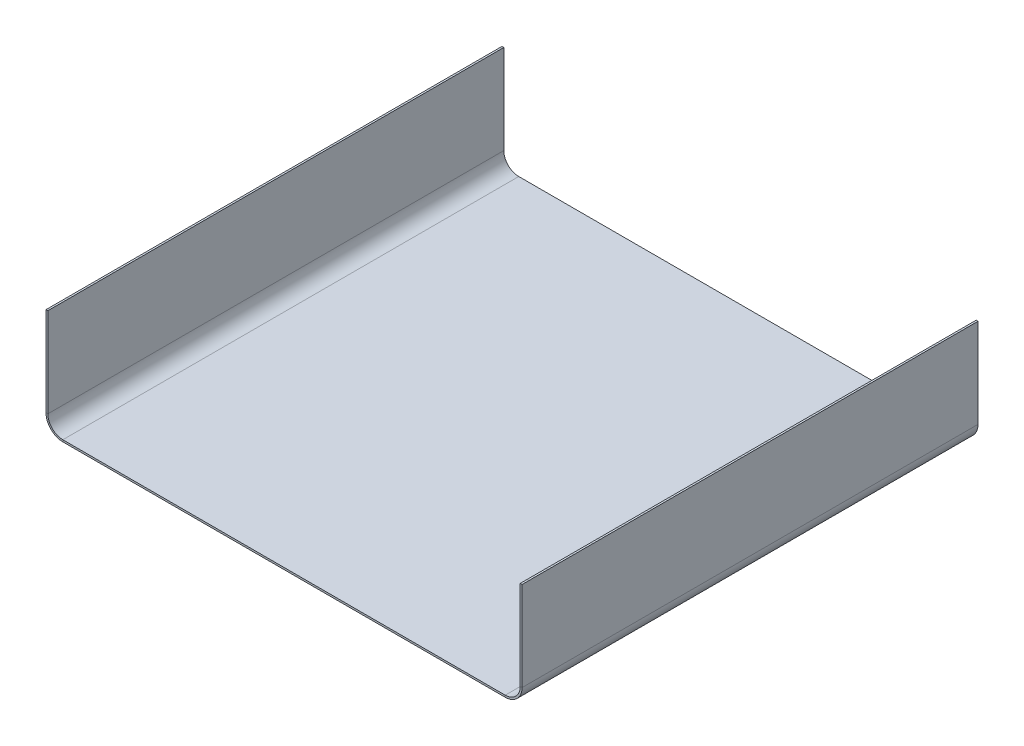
ISO-10303-21;
HEADER;
FILE_DESCRIPTION(('STEP AP214'),'2;1');
FILE_NAME('part.step','',(''),(''),'','','');
FILE_SCHEMA(('AUTOMOTIVE_DESIGN { 1 0 10303 214 1 1 1 1 }'));
ENDSEC;
DATA;
#1=APPLICATION_CONTEXT('core data for automotive mechanical design processes');
#2=APPLICATION_PROTOCOL_DEFINITION('international standard','automotive_design',2000,#1);
#3=PRODUCT_CONTEXT('',#1,'mechanical');
#4=PRODUCT('Part','Part','',(#3));
#5=PRODUCT_RELATED_PRODUCT_CATEGORY('part','',(#4));
#6=PRODUCT_DEFINITION_FORMATION('','',#4);
#7=PRODUCT_DEFINITION_CONTEXT('part definition',#1,'design');
#8=PRODUCT_DEFINITION('design','',#6,#7);
#9=PRODUCT_DEFINITION_SHAPE('','',#8);
#10=(LENGTH_UNIT() NAMED_UNIT(*) SI_UNIT(.MILLI.,.METRE.));
#11=(NAMED_UNIT(*) PLANE_ANGLE_UNIT() SI_UNIT($,.RADIAN.));
#12=(NAMED_UNIT(*) SI_UNIT($,.STERADIAN.) SOLID_ANGLE_UNIT());
#13=UNCERTAINTY_MEASURE_WITH_UNIT(LENGTH_MEASURE(1.E-05),#10,'distance_accuracy_value','');
#14=(GEOMETRIC_REPRESENTATION_CONTEXT(3) GLOBAL_UNCERTAINTY_ASSIGNED_CONTEXT((#13)) GLOBAL_UNIT_ASSIGNED_CONTEXT((#10,
#11,#12)) REPRESENTATION_CONTEXT('',''));
#15=CARTESIAN_POINT('',(0.,0.,0.));
#16=DIRECTION('',(0.,0.,1.));
#17=DIRECTION('',(1.,0.,0.));
#18=AXIS2_PLACEMENT_3D('',#15,#16,#17);
#19=CARTESIAN_POINT('',(-96.3051310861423,0.,193.548));
#20=DIRECTION('',(0.,0.,1.));
#21=DIRECTION('',(1.,0.,0.));
#22=AXIS2_PLACEMENT_3D('',#19,#20,#21);
#23=PLANE('',#22);
#24=DIRECTION('',(0.,-1.,0.));
#25=VECTOR('',#24,1.);
#26=CARTESIAN_POINT('',(-96.3051310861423,0.,193.548));
#27=LINE('',#26,#25);
#28=CARTESIAN_POINT('',(-96.3051310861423,0.,193.548));
#29=VERTEX_POINT('',#28);
#30=CARTESIAN_POINT('',(-96.3051310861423,-0.7874,193.548));
#31=VERTEX_POINT('',#30);
#32=EDGE_CURVE('E11',#29,#31,#27,.T.);
#33=ORIENTED_EDGE('',*,*,#32,.F.);
#34=CARTESIAN_POINT('',(-96.3051310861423,6.35,193.548));
#35=DIRECTION('',(0.,0.,-1.));
#36=DIRECTION('',(-1.,0.,0.));
#37=AXIS2_PLACEMENT_3D('',#34,#35,#36);
#38=CIRCLE('',#37,6.35);
#39=CARTESIAN_POINT('',(-102.655131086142,6.35,193.548));
#40=VERTEX_POINT('',#39);
#41=EDGE_CURVE('E243',#40,#29,#38,.F.);
#42=ORIENTED_EDGE('',*,*,#41,.F.);
#43=DIRECTION('',(1.,0.,0.));
#44=VECTOR('',#43,1.);
#45=CARTESIAN_POINT('',(-103.442531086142,6.35,193.548));
#46=LINE('',#45,#44);
#47=CARTESIAN_POINT('',(-103.442531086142,6.35,193.548));
#48=VERTEX_POINT('',#47);
#49=EDGE_CURVE('E41',#48,#40,#46,.T.);
#50=ORIENTED_EDGE('',*,*,#49,.F.);
#51=CARTESIAN_POINT('',(-96.3051310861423,6.35,193.548));
#52=DIRECTION('',(0.,0.,1.));
#53=DIRECTION('',(1.,0.,0.));
#54=AXIS2_PLACEMENT_3D('',#51,#52,#53);
#55=CIRCLE('',#54,7.1374);
#56=EDGE_CURVE('E142',#48,#31,#55,.T.);
#57=ORIENTED_EDGE('',*,*,#56,.T.);
#58=EDGE_LOOP('',(#33,#42,#50,#57));
#59=FACE_BOUND('',#58,.T.);
#60=ADVANCED_FACE('F33',(#59),#23,.T.);
#61=CARTESIAN_POINT('',(-103.442531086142,6.35,193.548));
#62=DIRECTION('',(0.,0.,1.));
#63=DIRECTION('',(1.,0.,0.));
#64=AXIS2_PLACEMENT_3D('',#61,#62,#63);
#65=PLANE('',#64);
#66=DIRECTION('',(1.,0.,0.));
#67=VECTOR('',#66,1.);
#68=CARTESIAN_POINT('',(-102.655131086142,0.,193.548));
#69=LINE('',#68,#67);
#70=CARTESIAN_POINT('',(91.505670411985,0.,193.548));
#71=VERTEX_POINT('',#70);
#72=EDGE_CURVE('E136',#29,#71,#69,.T.);
#73=ORIENTED_EDGE('',*,*,#72,.F.);
#74=ORIENTED_EDGE('',*,*,#32,.T.);
#75=DIRECTION('',(1.,0.,0.));
#76=VECTOR('',#75,1.);
#77=CARTESIAN_POINT('',(-102.655131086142,-0.7874,193.548));
#78=LINE('',#77,#76);
#79=CARTESIAN_POINT('',(91.505670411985,-0.7874,193.548));
#80=VERTEX_POINT('',#79);
#81=EDGE_CURVE('E133',#31,#80,#78,.T.);
#82=ORIENTED_EDGE('',*,*,#81,.T.);
#83=DIRECTION('',(0.,1.,0.));
#84=VECTOR('',#83,1.);
#85=CARTESIAN_POINT('',(91.505670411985,-0.7874,193.548));
#86=LINE('',#85,#84);
#87=EDGE_CURVE('E224',#80,#71,#86,.T.);
#88=ORIENTED_EDGE('',*,*,#87,.T.);
#89=EDGE_LOOP('',(#73,#74,#82,#88));
#90=FACE_BOUND('',#89,.T.);
#91=ADVANCED_FACE('F131',(#90),#65,.T.);
#92=CARTESIAN_POINT('',(-102.655131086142,6.35,0.));
#93=DIRECTION('',(0.,0.,-1.));
#94=DIRECTION('',(-1.,0.,0.));
#95=AXIS2_PLACEMENT_3D('',#92,#93,#94);
#96=PLANE('',#95);
#97=DIRECTION('',(-1.,0.,0.));
#98=VECTOR('',#97,1.);
#99=CARTESIAN_POINT('',(-102.655131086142,6.35,0.));
#100=LINE('',#99,#98);
#101=CARTESIAN_POINT('',(-102.655131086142,6.35,0.));
#102=VERTEX_POINT('',#101);
#103=CARTESIAN_POINT('',(-103.442531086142,6.35,0.));
#104=VERTEX_POINT('',#103);
#105=EDGE_CURVE('E229',#102,#104,#100,.T.);
#106=ORIENTED_EDGE('',*,*,#105,.F.);
#107=CARTESIAN_POINT('',(-96.3051310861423,6.35,0.));
#108=DIRECTION('',(0.,0.,-1.));
#109=DIRECTION('',(-1.,0.,0.));
#110=AXIS2_PLACEMENT_3D('',#107,#108,#109);
#111=CIRCLE('',#110,6.35);
#112=CARTESIAN_POINT('',(-96.3051310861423,0.,0.));
#113=VERTEX_POINT('',#112);
#114=EDGE_CURVE('E181',#102,#113,#111,.F.);
#115=ORIENTED_EDGE('',*,*,#114,.T.);
#116=DIRECTION('',(0.,1.,0.));
#117=VECTOR('',#116,1.);
#118=CARTESIAN_POINT('',(-96.3051310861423,-0.7874,0.));
#119=LINE('',#118,#117);
#120=CARTESIAN_POINT('',(-96.3051310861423,-0.7874,0.));
#121=VERTEX_POINT('',#120);
#122=EDGE_CURVE('E227',#121,#113,#119,.T.);
#123=ORIENTED_EDGE('',*,*,#122,.F.);
#124=CARTESIAN_POINT('',(-96.3051310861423,6.35,0.));
#125=DIRECTION('',(0.,0.,1.));
#126=DIRECTION('',(1.,0.,0.));
#127=AXIS2_PLACEMENT_3D('',#124,#125,#126);
#128=CIRCLE('',#127,7.1374);
#129=EDGE_CURVE('E154',#104,#121,#128,.T.);
#130=ORIENTED_EDGE('',*,*,#129,.F.);
#131=EDGE_LOOP('',(#106,#115,#123,#130));
#132=FACE_BOUND('',#131,.T.);
#133=ADVANCED_FACE('F281',(#132),#96,.T.);
#134=CARTESIAN_POINT('',(-96.3051310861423,-0.7874,0.));
#135=DIRECTION('',(0.,0.,-1.));
#136=DIRECTION('',(-1.,0.,0.));
#137=AXIS2_PLACEMENT_3D('',#134,#135,#136);
#138=PLANE('',#137);
#139=DIRECTION('',(0.,-1.,0.));
#140=VECTOR('',#139,1.);
#141=CARTESIAN_POINT('',(-102.655131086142,44.2616928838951,0.));
#142=LINE('',#141,#140);
#143=CARTESIAN_POINT('',(-102.655131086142,44.2616928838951,0.));
#144=VERTEX_POINT('',#143);
#145=EDGE_CURVE('E184',#144,#102,#142,.T.);
#146=ORIENTED_EDGE('',*,*,#145,.T.);
#147=ORIENTED_EDGE('',*,*,#105,.T.);
#148=DIRECTION('',(0.,1.,0.));
#149=VECTOR('',#148,1.);
#150=CARTESIAN_POINT('',(-103.442531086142,44.2616928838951,0.));
#151=LINE('',#150,#149);
#152=CARTESIAN_POINT('',(-103.442531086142,44.2616928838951,0.));
#153=VERTEX_POINT('',#152);
#154=EDGE_CURVE('E190',#153,#104,#151,.F.);
#155=ORIENTED_EDGE('',*,*,#154,.F.);
#156=DIRECTION('',(1.,0.,0.));
#157=VECTOR('',#156,1.);
#158=CARTESIAN_POINT('',(-103.442531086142,44.2616928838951,0.));
#159=LINE('',#158,#157);
#160=EDGE_CURVE('E187',#153,#144,#159,.T.);
#161=ORIENTED_EDGE('',*,*,#160,.T.);
#162=EDGE_LOOP('',(#146,#147,#155,#161));
#163=FACE_BOUND('',#162,.T.);
#164=ADVANCED_FACE('F284',(#163),#138,.T.);
#165=CARTESIAN_POINT('',(97.855670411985,6.35,193.548));
#166=DIRECTION('',(0.,0.,1.));
#167=DIRECTION('',(1.,0.,0.));
#168=AXIS2_PLACEMENT_3D('',#165,#166,#167);
#169=PLANE('',#168);
#170=DIRECTION('',(1.,0.,0.));
#171=VECTOR('',#170,1.);
#172=CARTESIAN_POINT('',(97.855670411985,6.35,193.548));
#173=LINE('',#172,#171);
#174=CARTESIAN_POINT('',(97.855670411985,6.35,193.548));
#175=VERTEX_POINT('',#174);
#176=CARTESIAN_POINT('',(98.643070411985,6.35,193.548));
#177=VERTEX_POINT('',#176);
#178=EDGE_CURVE('E49',#175,#177,#173,.T.);
#179=ORIENTED_EDGE('',*,*,#178,.F.);
#180=CARTESIAN_POINT('',(91.505670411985,6.35,193.548));
#181=DIRECTION('',(0.,0.,-1.));
#182=DIRECTION('',(-1.,0.,0.));
#183=AXIS2_PLACEMENT_3D('',#180,#181,#182);
#184=CIRCLE('',#183,6.35);
#185=EDGE_CURVE('E253',#71,#175,#184,.F.);
#186=ORIENTED_EDGE('',*,*,#185,.F.);
#187=ORIENTED_EDGE('',*,*,#87,.F.);
#188=CARTESIAN_POINT('',(91.505670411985,6.35,193.548));
#189=DIRECTION('',(0.,0.,1.));
#190=DIRECTION('',(1.,0.,0.));
#191=AXIS2_PLACEMENT_3D('',#188,#189,#190);
#192=CIRCLE('',#191,7.1374);
#193=EDGE_CURVE('E162',#80,#177,#192,.T.);
#194=ORIENTED_EDGE('',*,*,#193,.T.);
#195=EDGE_LOOP('',(#179,#186,#187,#194));
#196=FACE_BOUND('',#195,.T.);
#197=ADVANCED_FACE('F276',(#196),#169,.T.);
#198=CARTESIAN_POINT('',(91.505670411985,-0.7874,193.548));
#199=DIRECTION('',(0.,0.,1.));
#200=DIRECTION('',(1.,0.,0.));
#201=AXIS2_PLACEMENT_3D('',#198,#199,#200);
#202=PLANE('',#201);
#203=DIRECTION('',(0.,1.,0.));
#204=VECTOR('',#203,1.);
#205=CARTESIAN_POINT('',(97.855670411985,0.,193.548));
#206=LINE('',#205,#204);
#207=CARTESIAN_POINT('',(97.855670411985,44.2616928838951,193.548));
#208=VERTEX_POINT('',#207);
#209=EDGE_CURVE('E256',#175,#208,#206,.T.);
#210=ORIENTED_EDGE('',*,*,#209,.F.);
#211=ORIENTED_EDGE('',*,*,#178,.T.);
#212=DIRECTION('',(0.,1.,0.));
#213=VECTOR('',#212,1.);
#214=CARTESIAN_POINT('',(98.643070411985,0.,193.548));
#215=LINE('',#214,#213);
#216=CARTESIAN_POINT('',(98.643070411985,44.2616928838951,193.548));
#217=VERTEX_POINT('',#216);
#218=EDGE_CURVE('E103',#177,#217,#215,.T.);
#219=ORIENTED_EDGE('',*,*,#218,.T.);
#220=DIRECTION('',(1.,0.,0.));
#221=VECTOR('',#220,1.);
#222=CARTESIAN_POINT('',(97.855670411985,44.2616928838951,193.548));
#223=LINE('',#222,#221);
#224=EDGE_CURVE('E259',#208,#217,#223,.T.);
#225=ORIENTED_EDGE('',*,*,#224,.F.);
#226=EDGE_LOOP('',(#210,#211,#219,#225));
#227=FACE_BOUND('',#226,.T.);
#228=ADVANCED_FACE('F265',(#227),#202,.T.);
#229=CARTESIAN_POINT('',(91.505670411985,0.,0.));
#230=DIRECTION('',(0.,0.,-1.));
#231=DIRECTION('',(-1.,0.,0.));
#232=AXIS2_PLACEMENT_3D('',#229,#230,#231);
#233=PLANE('',#232);
#234=DIRECTION('',(0.,-1.,0.));
#235=VECTOR('',#234,1.);
#236=CARTESIAN_POINT('',(91.505670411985,0.,0.));
#237=LINE('',#236,#235);
#238=CARTESIAN_POINT('',(91.505670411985,0.,0.));
#239=VERTEX_POINT('',#238);
#240=CARTESIAN_POINT('',(91.505670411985,-0.7874,0.));
#241=VERTEX_POINT('',#240);
#242=EDGE_CURVE('E90',#239,#241,#237,.T.);
#243=ORIENTED_EDGE('',*,*,#242,.F.);
#244=CARTESIAN_POINT('',(91.505670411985,6.35,0.));
#245=DIRECTION('',(0.,0.,-1.));
#246=DIRECTION('',(-1.,0.,0.));
#247=AXIS2_PLACEMENT_3D('',#244,#245,#246);
#248=CIRCLE('',#247,6.35);
#249=CARTESIAN_POINT('',(97.855670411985,6.35,0.));
#250=VERTEX_POINT('',#249);
#251=EDGE_CURVE('E177',#239,#250,#248,.F.);
#252=ORIENTED_EDGE('',*,*,#251,.T.);
#253=DIRECTION('',(-1.,0.,0.));
#254=VECTOR('',#253,1.);
#255=CARTESIAN_POINT('',(98.643070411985,6.35,0.));
#256=LINE('',#255,#254);
#257=CARTESIAN_POINT('',(98.643070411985,6.35,0.));
#258=VERTEX_POINT('',#257);
#259=EDGE_CURVE('E97',#258,#250,#256,.T.);
#260=ORIENTED_EDGE('',*,*,#259,.F.);
#261=CARTESIAN_POINT('',(91.505670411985,6.35,0.));
#262=DIRECTION('',(0.,0.,1.));
#263=DIRECTION('',(1.,0.,0.));
#264=AXIS2_PLACEMENT_3D('',#261,#262,#263);
#265=CIRCLE('',#264,7.1374);
#266=EDGE_CURVE('E196',#241,#258,#265,.T.);
#267=ORIENTED_EDGE('',*,*,#266,.F.);
#268=EDGE_LOOP('',(#243,#252,#260,#267));
#269=FACE_BOUND('',#268,.T.);
#270=ADVANCED_FACE('F313',(#269),#233,.T.);
#271=CARTESIAN_POINT('',(98.643070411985,6.35,0.));
#272=DIRECTION('',(0.,0.,-1.));
#273=DIRECTION('',(-1.,0.,0.));
#274=AXIS2_PLACEMENT_3D('',#271,#272,#273);
#275=PLANE('',#274);
#276=DIRECTION('',(1.,0.,0.));
#277=VECTOR('',#276,1.);
#278=CARTESIAN_POINT('',(-102.655131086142,0.,0.));
#279=LINE('',#278,#277);
#280=EDGE_CURVE('E179',#113,#239,#279,.T.);
#281=ORIENTED_EDGE('',*,*,#280,.T.);
#282=ORIENTED_EDGE('',*,*,#242,.T.);
#283=DIRECTION('',(1.,0.,0.));
#284=VECTOR('',#283,1.);
#285=CARTESIAN_POINT('',(-102.655131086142,-0.7874,0.));
#286=LINE('',#285,#284);
#287=EDGE_CURVE('E194',#121,#241,#286,.T.);
#288=ORIENTED_EDGE('',*,*,#287,.F.);
#289=ORIENTED_EDGE('',*,*,#122,.T.);
#290=EDGE_LOOP('',(#281,#282,#288,#289));
#291=FACE_BOUND('',#290,.T.);
#292=ADVANCED_FACE('F316',(#291),#275,.T.);
#293=CARTESIAN_POINT('',(98.643070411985,0.,193.548));
#294=DIRECTION('',(-1.,0.,0.));
#295=DIRECTION('',(0.,0.,1.));
#296=AXIS2_PLACEMENT_3D('',#293,#294,#295);
#297=PLANE('',#296);
#298=DIRECTION('',(0.,1.,0.));
#299=VECTOR('',#298,1.);
#300=CARTESIAN_POINT('',(98.643070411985,0.,0.));
#301=LINE('',#300,#299);
#302=CARTESIAN_POINT('',(98.643070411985,44.2616928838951,0.));
#303=VERTEX_POINT('',#302);
#304=EDGE_CURVE('E168',#258,#303,#301,.T.);
#305=ORIENTED_EDGE('',*,*,#304,.T.);
#306=DIRECTION('',(0.,0.,-1.));
#307=VECTOR('',#306,1.);
#308=CARTESIAN_POINT('',(98.643070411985,44.2616928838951,193.548));
#309=LINE('',#308,#307);
#310=EDGE_CURVE('E220',#217,#303,#309,.T.);
#311=ORIENTED_EDGE('',*,*,#310,.F.);
#312=ORIENTED_EDGE('',*,*,#218,.F.);
#313=DIRECTION('',(0.,0.,-1.));
#314=VECTOR('',#313,1.);
#315=CARTESIAN_POINT('',(98.643070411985,6.35,193.548));
#316=LINE('',#315,#314);
#317=EDGE_CURVE('E164',#177,#258,#316,.T.);
#318=ORIENTED_EDGE('',*,*,#317,.T.);
#319=EDGE_LOOP('',(#305,#311,#312,#318));
#320=FACE_BOUND('',#319,.T.);
#321=ADVANCED_FACE('F319',(#320),#297,.F.);
#322=CARTESIAN_POINT('',(97.855670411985,44.2616928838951,193.548));
#323=DIRECTION('',(0.,1.,0.));
#324=DIRECTION('',(0.,0.,1.));
#325=AXIS2_PLACEMENT_3D('',#322,#323,#324);
#326=PLANE('',#325);
#327=DIRECTION('',(1.,0.,0.));
#328=VECTOR('',#327,1.);
#329=CARTESIAN_POINT('',(97.855670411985,44.2616928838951,0.));
#330=LINE('',#329,#328);
#331=CARTESIAN_POINT('',(97.855670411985,44.2616928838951,0.));
#332=VERTEX_POINT('',#331);
#333=EDGE_CURVE('E171',#332,#303,#330,.T.);
#334=ORIENTED_EDGE('',*,*,#333,.F.);
#335=DIRECTION('',(0.,0.,-1.));
#336=VECTOR('',#335,1.);
#337=CARTESIAN_POINT('',(97.855670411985,44.2616928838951,193.548));
#338=LINE('',#337,#336);
#339=EDGE_CURVE('E218',#208,#332,#338,.T.);
#340=ORIENTED_EDGE('',*,*,#339,.F.);
#341=ORIENTED_EDGE('',*,*,#224,.T.);
#342=ORIENTED_EDGE('',*,*,#310,.T.);
#343=EDGE_LOOP('',(#334,#340,#341,#342));
#344=FACE_BOUND('',#343,.T.);
#345=ADVANCED_FACE('F264',(#344),#326,.T.);
#346=CARTESIAN_POINT('',(97.855670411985,0.,193.548));
#347=DIRECTION('',(-1.,0.,0.));
#348=DIRECTION('',(0.,0.,1.));
#349=AXIS2_PLACEMENT_3D('',#346,#347,#348);
#350=PLANE('',#349);
#351=DIRECTION('',(0.,1.,0.));
#352=VECTOR('',#351,1.);
#353=CARTESIAN_POINT('',(97.855670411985,0.,0.));
#354=LINE('',#353,#352);
#355=EDGE_CURVE('E174',#250,#332,#354,.T.);
#356=ORIENTED_EDGE('',*,*,#355,.F.);
#357=DIRECTION('',(0.,0.,-1.));
#358=VECTOR('',#357,1.);
#359=CARTESIAN_POINT('',(97.855670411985,6.35,193.548));
#360=LINE('',#359,#358);
#361=EDGE_CURVE('E215',#175,#250,#360,.T.);
#362=ORIENTED_EDGE('',*,*,#361,.F.);
#363=ORIENTED_EDGE('',*,*,#209,.T.);
#364=ORIENTED_EDGE('',*,*,#339,.T.);
#365=EDGE_LOOP('',(#356,#362,#363,#364));
#366=FACE_BOUND('',#365,.T.);
#367=ADVANCED_FACE('F269',(#366),#350,.T.);
#368=CARTESIAN_POINT('',(91.505670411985,6.35,193.548));
#369=DIRECTION('',(0.,0.,-1.));
#370=DIRECTION('',(-1.,0.,0.));
#371=AXIS2_PLACEMENT_3D('',#368,#369,#370);
#372=CYLINDRICAL_SURFACE('',#371,6.35);
#373=ORIENTED_EDGE('',*,*,#251,.F.);
#374=DIRECTION('',(0.,0.,-1.));
#375=VECTOR('',#374,1.);
#376=CARTESIAN_POINT('',(91.505670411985,0.,193.548));
#377=LINE('',#376,#375);
#378=EDGE_CURVE('E212',#71,#239,#377,.T.);
#379=ORIENTED_EDGE('',*,*,#378,.F.);
#380=ORIENTED_EDGE('',*,*,#185,.T.);
#381=ORIENTED_EDGE('',*,*,#361,.T.);
#382=EDGE_LOOP('',(#373,#379,#380,#381));
#383=FACE_BOUND('',#382,.T.);
#384=ADVANCED_FACE('F272',(#383),#372,.F.);
#385=CARTESIAN_POINT('',(-102.655131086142,0.,193.548));
#386=DIRECTION('',(0.,1.,0.));
#387=DIRECTION('',(0.,0.,1.));
#388=AXIS2_PLACEMENT_3D('',#385,#386,#387);
#389=PLANE('',#388);
#390=ORIENTED_EDGE('',*,*,#280,.F.);
#391=DIRECTION('',(0.,0.,-1.));
#392=VECTOR('',#391,1.);
#393=CARTESIAN_POINT('',(-96.3051310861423,0.,193.548));
#394=LINE('',#393,#392);
#395=EDGE_CURVE('E209',#29,#113,#394,.T.);
#396=ORIENTED_EDGE('',*,*,#395,.F.);
#397=ORIENTED_EDGE('',*,*,#72,.T.);
#398=ORIENTED_EDGE('',*,*,#378,.T.);
#399=EDGE_LOOP('',(#390,#396,#397,#398));
#400=FACE_BOUND('',#399,.T.);
#401=ADVANCED_FACE('F279',(#400),#389,.T.);
#402=CARTESIAN_POINT('',(-96.3051310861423,6.35,193.548));
#403=DIRECTION('',(0.,0.,-1.));
#404=DIRECTION('',(-1.,0.,0.));
#405=AXIS2_PLACEMENT_3D('',#402,#403,#404);
#406=CYLINDRICAL_SURFACE('',#405,6.35);
#407=ORIENTED_EDGE('',*,*,#114,.F.);
#408=DIRECTION('',(0.,0.,-1.));
#409=VECTOR('',#408,1.);
#410=CARTESIAN_POINT('',(-102.655131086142,6.35,193.548));
#411=LINE('',#410,#409);
#412=EDGE_CURVE('E206',#40,#102,#411,.T.);
#413=ORIENTED_EDGE('',*,*,#412,.F.);
#414=ORIENTED_EDGE('',*,*,#41,.T.);
#415=ORIENTED_EDGE('',*,*,#395,.T.);
#416=EDGE_LOOP('',(#407,#413,#414,#415));
#417=FACE_BOUND('',#416,.T.);
#418=ADVANCED_FACE('F242',(#417),#406,.F.);
#419=CARTESIAN_POINT('',(-102.655131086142,44.2616928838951,193.548));
#420=DIRECTION('',(1.,0.,0.));
#421=DIRECTION('',(0.,0.,-1.));
#422=AXIS2_PLACEMENT_3D('',#419,#420,#421);
#423=PLANE('',#422);
#424=ORIENTED_EDGE('',*,*,#145,.F.);
#425=DIRECTION('',(0.,0.,-1.));
#426=VECTOR('',#425,1.);
#427=CARTESIAN_POINT('',(-102.655131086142,44.2616928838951,193.548));
#428=LINE('',#427,#426);
#429=CARTESIAN_POINT('',(-102.655131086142,44.2616928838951,193.548));
#430=VERTEX_POINT('',#429);
#431=EDGE_CURVE('E204',#430,#144,#428,.T.);
#432=ORIENTED_EDGE('',*,*,#431,.F.);
#433=DIRECTION('',(0.,-1.,0.));
#434=VECTOR('',#433,1.);
#435=CARTESIAN_POINT('',(-102.655131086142,44.2616928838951,193.548));
#436=LINE('',#435,#434);
#437=EDGE_CURVE('E236',#430,#40,#436,.T.);
#438=ORIENTED_EDGE('',*,*,#437,.T.);
#439=ORIENTED_EDGE('',*,*,#412,.T.);
#440=EDGE_LOOP('',(#424,#432,#438,#439));
#441=FACE_BOUND('',#440,.T.);
#442=ADVANCED_FACE('F247',(#441),#423,.T.);
#443=CARTESIAN_POINT('',(-103.442531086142,44.2616928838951,193.548));
#444=DIRECTION('',(0.,1.,0.));
#445=DIRECTION('',(0.,0.,1.));
#446=AXIS2_PLACEMENT_3D('',#443,#444,#445);
#447=PLANE('',#446);
#448=ORIENTED_EDGE('',*,*,#160,.F.);
#449=DIRECTION('',(0.,0.,-1.));
#450=VECTOR('',#449,1.);
#451=CARTESIAN_POINT('',(-103.442531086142,44.2616928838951,193.548));
#452=LINE('',#451,#450);
#453=CARTESIAN_POINT('',(-103.442531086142,44.2616928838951,193.548));
#454=VERTEX_POINT('',#453);
#455=EDGE_CURVE('E202',#454,#153,#452,.T.);
#456=ORIENTED_EDGE('',*,*,#455,.F.);
#457=DIRECTION('',(1.,0.,0.));
#458=VECTOR('',#457,1.);
#459=CARTESIAN_POINT('',(-103.442531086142,44.2616928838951,193.548));
#460=LINE('',#459,#458);
#461=EDGE_CURVE('E248',#454,#430,#460,.T.);
#462=ORIENTED_EDGE('',*,*,#461,.T.);
#463=ORIENTED_EDGE('',*,*,#431,.T.);
#464=EDGE_LOOP('',(#448,#456,#462,#463));
#465=FACE_BOUND('',#464,.T.);
#466=ADVANCED_FACE('F289',(#465),#447,.T.);
#467=CARTESIAN_POINT('',(-103.442531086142,44.2616928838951,193.548));
#468=DIRECTION('',(1.,0.,0.));
#469=DIRECTION('',(0.,0.,-1.));
#470=AXIS2_PLACEMENT_3D('',#467,#468,#469);
#471=PLANE('',#470);
#472=ORIENTED_EDGE('',*,*,#154,.T.);
#473=DIRECTION('',(0.,0.,-1.));
#474=VECTOR('',#473,1.);
#475=CARTESIAN_POINT('',(-103.442531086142,6.35,193.548));
#476=LINE('',#475,#474);
#477=EDGE_CURVE('E156',#48,#104,#476,.T.);
#478=ORIENTED_EDGE('',*,*,#477,.F.);
#479=DIRECTION('',(0.,1.,0.));
#480=VECTOR('',#479,1.);
#481=CARTESIAN_POINT('',(-103.442531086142,44.2616928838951,193.548));
#482=LINE('',#481,#480);
#483=EDGE_CURVE('E147',#454,#48,#482,.F.);
#484=ORIENTED_EDGE('',*,*,#483,.F.);
#485=ORIENTED_EDGE('',*,*,#455,.T.);
#486=EDGE_LOOP('',(#472,#478,#484,#485));
#487=FACE_BOUND('',#486,.T.);
#488=ADVANCED_FACE('F287',(#487),#471,.F.);
#489=CARTESIAN_POINT('',(-96.3051310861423,6.35,193.548));
#490=DIRECTION('',(0.,0.,-1.));
#491=DIRECTION('',(-1.,0.,0.));
#492=AXIS2_PLACEMENT_3D('',#489,#490,#491);
#493=CYLINDRICAL_SURFACE('',#492,7.1374);
#494=ORIENTED_EDGE('',*,*,#129,.T.);
#495=DIRECTION('',(0.,0.,-1.));
#496=VECTOR('',#495,1.);
#497=CARTESIAN_POINT('',(-96.3051310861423,-0.7874,193.548));
#498=LINE('',#497,#496);
#499=EDGE_CURVE('E151',#31,#121,#498,.T.);
#500=ORIENTED_EDGE('',*,*,#499,.F.);
#501=ORIENTED_EDGE('',*,*,#56,.F.);
#502=ORIENTED_EDGE('',*,*,#477,.T.);
#503=EDGE_LOOP('',(#494,#500,#501,#502));
#504=FACE_BOUND('',#503,.T.);
#505=ADVANCED_FACE('F152',(#504),#493,.T.);
#506=CARTESIAN_POINT('',(-102.655131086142,-0.7874,193.548));
#507=DIRECTION('',(0.,1.,0.));
#508=DIRECTION('',(0.,0.,1.));
#509=AXIS2_PLACEMENT_3D('',#506,#507,#508);
#510=PLANE('',#509);
#511=ORIENTED_EDGE('',*,*,#287,.T.);
#512=DIRECTION('',(0.,0.,-1.));
#513=VECTOR('',#512,1.);
#514=CARTESIAN_POINT('',(91.505670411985,-0.7874,193.548));
#515=LINE('',#514,#513);
#516=EDGE_CURVE('E157',#80,#241,#515,.T.);
#517=ORIENTED_EDGE('',*,*,#516,.F.);
#518=ORIENTED_EDGE('',*,*,#81,.F.);
#519=ORIENTED_EDGE('',*,*,#499,.T.);
#520=EDGE_LOOP('',(#511,#517,#518,#519));
#521=FACE_BOUND('',#520,.T.);
#522=ADVANCED_FACE('F159',(#521),#510,.F.);
#523=CARTESIAN_POINT('',(91.505670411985,6.35,193.548));
#524=DIRECTION('',(0.,0.,-1.));
#525=DIRECTION('',(-1.,0.,0.));
#526=AXIS2_PLACEMENT_3D('',#523,#524,#525);
#527=CYLINDRICAL_SURFACE('',#526,7.1374);
#528=ORIENTED_EDGE('',*,*,#266,.T.);
#529=ORIENTED_EDGE('',*,*,#317,.F.);
#530=ORIENTED_EDGE('',*,*,#193,.F.);
#531=ORIENTED_EDGE('',*,*,#516,.T.);
#532=EDGE_LOOP('',(#528,#529,#530,#531));
#533=FACE_BOUND('',#532,.T.);
#534=ADVANCED_FACE('F371',(#533),#527,.T.);
#535=CARTESIAN_POINT('',(91.505670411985,6.35,193.548));
#536=DIRECTION('',(0.,0.,-1.));
#537=DIRECTION('',(-1.,0.,0.));
#538=AXIS2_PLACEMENT_3D('',#535,#536,#537);
#539=PLANE('',#538);
#540=ORIENTED_EDGE('',*,*,#483,.T.);
#541=ORIENTED_EDGE('',*,*,#49,.T.);
#542=ORIENTED_EDGE('',*,*,#437,.F.);
#543=ORIENTED_EDGE('',*,*,#461,.F.);
#544=EDGE_LOOP('',(#540,#541,#542,#543));
#545=FACE_BOUND('',#544,.T.);
#546=ADVANCED_FACE('F233',(#545),#539,.F.);
#547=CARTESIAN_POINT('',(91.505670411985,6.35,0.));
#548=DIRECTION('',(0.,0.,-1.));
#549=DIRECTION('',(-1.,0.,0.));
#550=AXIS2_PLACEMENT_3D('',#547,#548,#549);
#551=PLANE('',#550);
#552=ORIENTED_EDGE('',*,*,#304,.F.);
#553=ORIENTED_EDGE('',*,*,#259,.T.);
#554=ORIENTED_EDGE('',*,*,#355,.T.);
#555=ORIENTED_EDGE('',*,*,#333,.T.);
#556=EDGE_LOOP('',(#552,#553,#554,#555));
#557=FACE_BOUND('',#556,.T.);
#558=ADVANCED_FACE('F391',(#557),#551,.T.);
#559=CLOSED_SHELL('',(#60,#91,#133,#164,#197,#228,#270,#292,#321,#345,#367,#384,#401,#418,#442,
#466,#488,#505,#522,#534,#546,#558));
#560=MANIFOLD_SOLID_BREP('B2',#559);
#561=ADVANCED_BREP_SHAPE_REPRESENTATION('',(#18,#560),#14);
#562=SHAPE_DEFINITION_REPRESENTATION(#9,#561);
ENDSEC;
END-ISO-10303-21;
